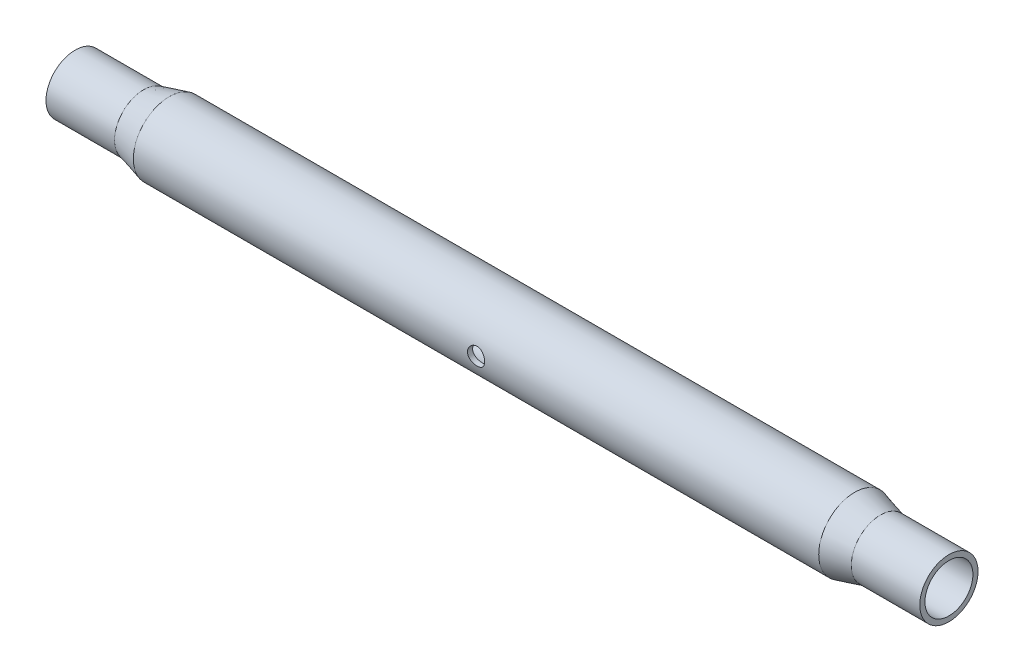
from build123d import *

# Parameters (mm, degrees)
ESQUISSE2_R             = 5
ENL_V_MAT_EXTRU_1_DEPTH = 30


with BuildPart() as part:
    # Esquisse1 → R_vol.-Mince1 (revolve)
    with BuildSketch(Plane.XY, mode=Mode.PRIVATE) as r_vol_mince1_sk:
        Polygon((-67.008472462, 17), (-27.008472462, 17), (-12.008472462, 21), (387.991527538, 21), (402.991527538, 17), (442.991527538, 17), (442.991527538, 14), (402.598396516, 14), (387.598396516, 18), (-11.61534144, 18), (-26.61534144, 14), (-67.008472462, 14), align=None)
    revolve(r_vol_mince1_sk.sketch.rotate(Axis((-91.895693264, 0, 0), (1, 0, 0)), 90), axis=Axis((-91.895693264, 0, 0), (1, 0, 0)))

    # Esquisse2 → Enl_v. mat.-Extru.1 (cut, symmetric)
    with BuildSketch(Plane.XY):
        with Locations((187.991527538, 0)):
            Circle(ESQUISSE2_R)
    extrude(amount=ENL_V_MAT_EXTRU_1_DEPTH, both=True, mode=Mode.SUBTRACT)


solid = part.part
